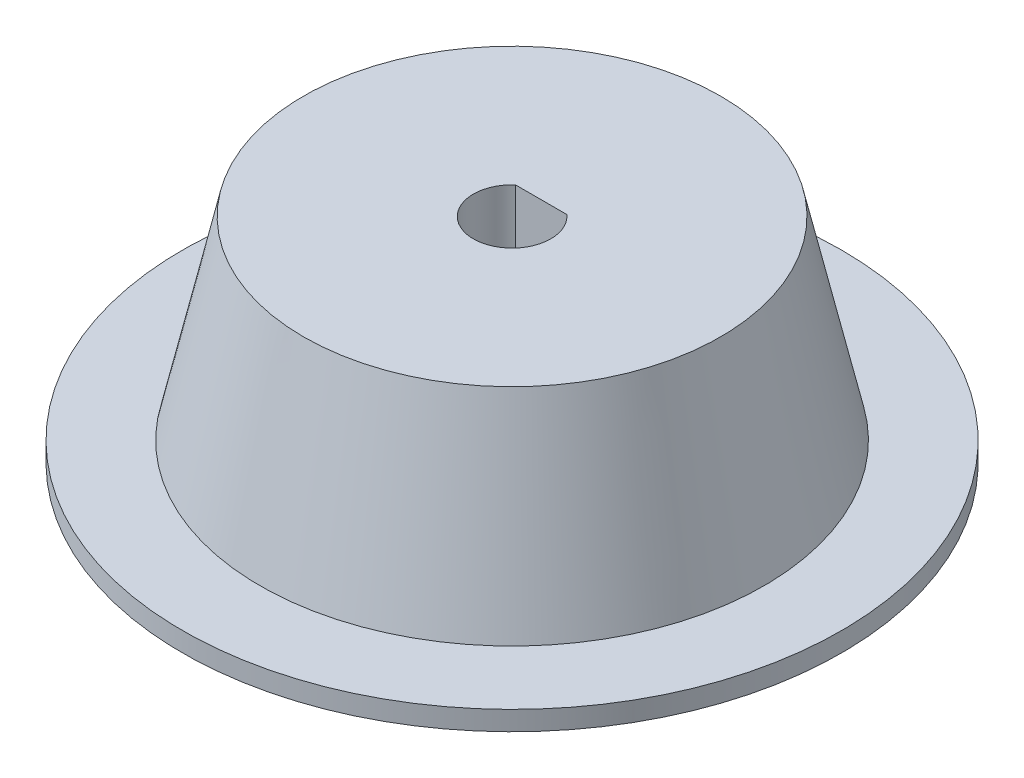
from build123d import *

# Parameters (mm, degrees)
SKETCH1_R           = 13
BOSS_EXTRUDE1_DEPTH = 10
SKETCH3_R           = 17
BOSS_EXTRUDE2_DEPTH = 1
CUT_EXTRUDE2_DEPTH  = 27.438608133


with BuildPart() as part:
    # Sketch1 → Boss-Extrude1 (new body)
    with BuildSketch(Plane(origin=(0, 0, 0), x_dir=(1, 0, 0), z_dir=(0, 1, 0))):
        with Locations(Location((0, 0, 0), (0, 0, 270))):
            Circle(SKETCH1_R)
    extrude(amount=BOSS_EXTRUDE1_DEPTH)

    # Sketch2 → Cut-Revolve1 (revolve, cut)
    with BuildSketch(Plane(origin=(0, 0, 0), x_dir=(0, 0, -1), z_dir=(1, 0, 0)), mode=Mode.PRIVATE) as cut_revolve1_sk:
        Polygon((-13, 0), (-10.757403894, 10), (-13, 10), align=None)
    revolve(cut_revolve1_sk.sketch.rotate(Axis((0, 0, 0), (0, 1, 0)), 180), axis=Axis((0, 0, 0), (0, 1, 0)), mode=Mode.SUBTRACT)

    # Sketch3 → Boss-Extrude2 (add)
    with BuildSketch(Plane(origin=(0, 0, 0), x_dir=(-1, 0, 0), z_dir=(0, -1, 0))):
        with Locations(Location((0, 0, 0), (0, 0, 90))):
            Circle(SKETCH3_R)
    extrude(amount=BOSS_EXTRUDE2_DEPTH)

    # Sketch5 → Cut-Extrude2 (cut, through all)
    with BuildSketch(Plane(origin=(0, 10, 0), x_dir=(1, 0, 0), z_dir=(0, 1, 0))):
        with BuildLine():
            Line((1.322875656, 1.5), (-1.322875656, 1.5))
            ThreePointArc((-1.322875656, 1.5), (-0.822875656, -1.822875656), (2, 0))
            ThreePointArc((2, 0), (1.822875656, 0.822875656), (1.322875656, 1.5))
        make_face()
    extrude(amount=-CUT_EXTRUDE2_DEPTH, mode=Mode.SUBTRACT)


solid = part.part
